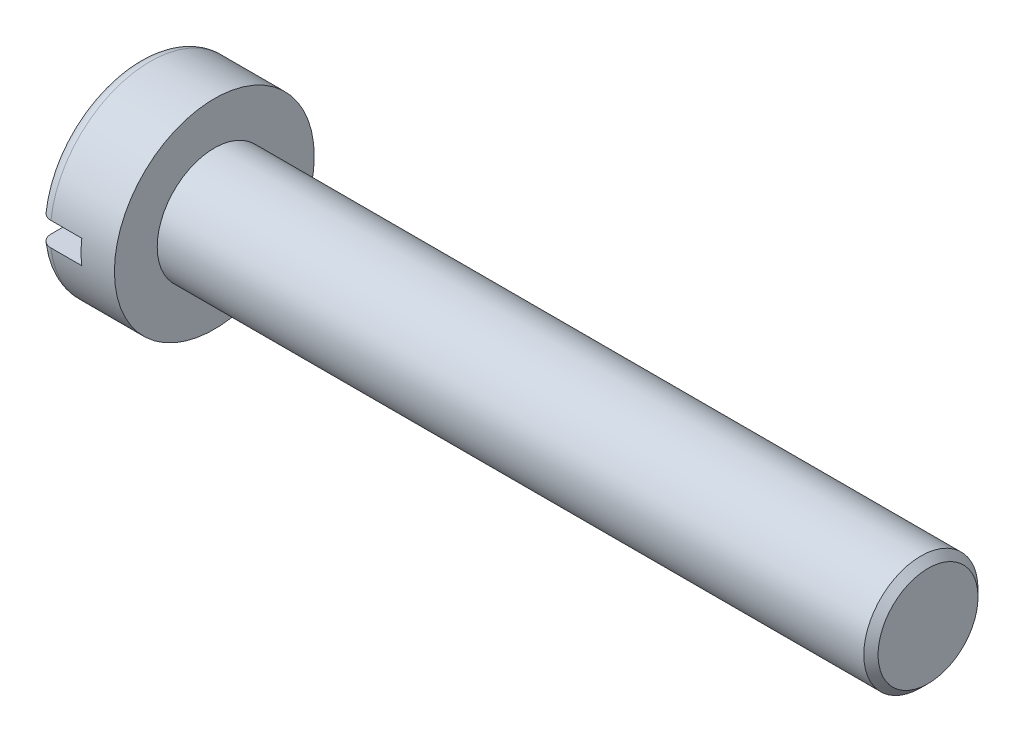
from build123d import *

# Parameters (mm, degrees)
ESQUISSE2_W             = 1.8
ESQUISSE2_H             = 1
ENL_V_MAT_EXTRU_1_DEPTH = 5
ESQUISSE3_R             = 2.4
EXTRUSION1_DEPTH        = 30
CHANFREIN1_SIZE         = 0.3


with BuildPart() as part:
    # Esquisse1 → R_volution1 (revolve)
    with BuildSketch(Plane.XY, mode=Mode.PRIVATE) as r_volution1_sk:
        with BuildLine():
            Line((0, 0), (3.2, 0))
            Line((3.2, 0), (3.2, 4.2))
            Line((3.2, 4.2), (0.5, 4.2))
            ThreePointArc((0.5, 4.2), (0.146446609, 4.053553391), (0, 3.7))
            Line((0, 3.7), (0, 0))
        make_face()
    revolve(r_volution1_sk.sketch.rotate(Axis((0, 0, 0), (1, 0, 0)), 90), axis=Axis((0, 0, 0), (1, 0, 0)))

    # Esquisse2 → Enl_v. mat.-Extru.1 (cut, symmetric)
    with BuildSketch(Plane.XY):
        with Locations((0.9, 0)):
            Rectangle(ESQUISSE2_W, ESQUISSE2_H)
    extrude(amount=ENL_V_MAT_EXTRU_1_DEPTH, both=True, mode=Mode.SUBTRACT)

    # Esquisse3 → Extrusion1 (add)
    with BuildSketch(Plane(origin=(3.2, 0, 0), x_dir=(0, 0, -1), z_dir=(1, 0, 0))):
        with Locations(Location((0, 0, 0), (0, 0, 180))):
            Circle(ESQUISSE3_R)
    extrude(amount=EXTRUSION1_DEPTH)

    # Chanfrein1
    chanfrein1_edges = [part.edges().sort_by_distance(p)[0] for p in [
        (33.2, 0, -2.4),
    ]]
    chamfer(chanfrein1_edges, length=CHANFREIN1_SIZE)


solid = part.part
